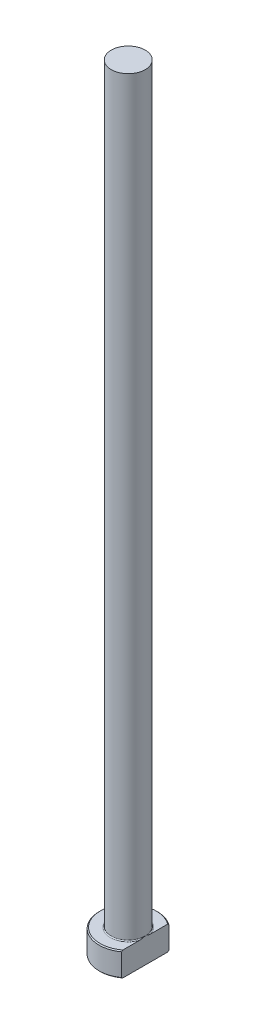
ISO-10303-21;
HEADER;
FILE_DESCRIPTION(('STEP AP214'),'2;1');
FILE_NAME('part.step','',(''),(''),'','','');
FILE_SCHEMA(('AUTOMOTIVE_DESIGN { 1 0 10303 214 1 1 1 1 }'));
ENDSEC;
DATA;
#1=APPLICATION_CONTEXT('core data for automotive mechanical design processes');
#2=APPLICATION_PROTOCOL_DEFINITION('international standard','automotive_design',2000,#1);
#3=PRODUCT_CONTEXT('',#1,'mechanical');
#4=PRODUCT('Part','Part','',(#3));
#5=PRODUCT_RELATED_PRODUCT_CATEGORY('part','',(#4));
#6=PRODUCT_DEFINITION_FORMATION('','',#4);
#7=PRODUCT_DEFINITION_CONTEXT('part definition',#1,'design');
#8=PRODUCT_DEFINITION('design','',#6,#7);
#9=PRODUCT_DEFINITION_SHAPE('','',#8);
#10=(LENGTH_UNIT() NAMED_UNIT(*) SI_UNIT(.MILLI.,.METRE.));
#11=(NAMED_UNIT(*) PLANE_ANGLE_UNIT() SI_UNIT($,.RADIAN.));
#12=(NAMED_UNIT(*) SI_UNIT($,.STERADIAN.) SOLID_ANGLE_UNIT());
#13=UNCERTAINTY_MEASURE_WITH_UNIT(LENGTH_MEASURE(1.E-05),#10,'distance_accuracy_value','');
#14=(GEOMETRIC_REPRESENTATION_CONTEXT(3) GLOBAL_UNCERTAINTY_ASSIGNED_CONTEXT((#13)) GLOBAL_UNIT_ASSIGNED_CONTEXT((#10,
#11,#12)) REPRESENTATION_CONTEXT('',''));
#15=CARTESIAN_POINT('',(0.,0.,0.));
#16=DIRECTION('',(0.,0.,1.));
#17=DIRECTION('',(1.,0.,0.));
#18=AXIS2_PLACEMENT_3D('',#15,#16,#17);
#19=CARTESIAN_POINT('',(0.,0.,0.));
#20=DIRECTION('',(0.,-1.,0.));
#21=DIRECTION('',(0.,0.,-1.));
#22=AXIS2_PLACEMENT_3D('',#19,#20,#21);
#23=PLANE('',#22);
#24=CARTESIAN_POINT('',(0.,0.,0.));
#25=DIRECTION('',(0.,-1.,0.));
#26=DIRECTION('',(0.,0.,-1.));
#27=AXIS2_PLACEMENT_3D('',#24,#25,#26);
#28=CIRCLE('',#27,5.79999999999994);
#29=CARTESIAN_POINT('',(3.49999999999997,0.,4.62493243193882));
#30=VERTEX_POINT('',#29);
#31=CARTESIAN_POINT('',(3.49999999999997,0.,-4.62493243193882));
#32=VERTEX_POINT('',#31);
#33=EDGE_CURVE('E98',#30,#32,#28,.T.);
#34=ORIENTED_EDGE('',*,*,#33,.T.);
#35=DIRECTION('',(0.,0.,1.));
#36=VECTOR('',#35,1.);
#37=CARTESIAN_POINT('',(3.49999999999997,0.,-4.87339717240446));
#38=LINE('',#37,#36);
#39=EDGE_CURVE('E83',#32,#30,#38,.T.);
#40=ORIENTED_EDGE('',*,*,#39,.T.);
#41=EDGE_LOOP('',(#34,#40));
#42=FACE_BOUND('',#41,.T.);
#43=ADVANCED_FACE('F32',(#42),#23,.T.);
#44=CARTESIAN_POINT('',(0.,259.958771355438,0.));
#45=DIRECTION('',(0.,1.,0.));
#46=DIRECTION('',(0.,0.,1.));
#47=AXIS2_PLACEMENT_3D('',#44,#45,#46);
#48=CYLINDRICAL_SURFACE('',#47,5.99999999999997);
#49=CARTESIAN_POINT('',(0.,4.80000000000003,0.));
#50=DIRECTION('',(0.,1.,0.));
#51=DIRECTION('',(0.,0.,1.));
#52=AXIS2_PLACEMENT_3D('',#49,#50,#51);
#53=CIRCLE('',#52,5.99999999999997);
#54=CARTESIAN_POINT('',(3.49999999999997,4.80000000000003,4.87339717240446));
#55=VERTEX_POINT('',#54);
#56=CARTESIAN_POINT('',(3.49999999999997,4.80000000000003,-4.87339717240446));
#57=VERTEX_POINT('',#56);
#58=EDGE_CURVE('E104',#55,#57,#53,.F.);
#59=ORIENTED_EDGE('',*,*,#58,.T.);
#60=DIRECTION('',(0.,-1.,0.));
#61=VECTOR('',#60,1.);
#62=CARTESIAN_POINT('',(3.49999999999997,160.,-4.87339717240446));
#63=LINE('',#62,#61);
#64=CARTESIAN_POINT('',(3.49999999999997,0.200000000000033,-4.87339717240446));
#65=VERTEX_POINT('',#64);
#66=EDGE_CURVE('E183',#57,#65,#63,.T.);
#67=ORIENTED_EDGE('',*,*,#66,.T.);
#68=CARTESIAN_POINT('',(0.,0.200000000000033,0.));
#69=DIRECTION('',(0.,-1.,0.));
#70=DIRECTION('',(0.,0.,-1.));
#71=AXIS2_PLACEMENT_3D('',#68,#69,#70);
#72=CIRCLE('',#71,5.99999999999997);
#73=CARTESIAN_POINT('',(3.49999999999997,0.200000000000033,4.87339717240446));
#74=VERTEX_POINT('',#73);
#75=EDGE_CURVE('E100',#65,#74,#72,.F.);
#76=ORIENTED_EDGE('',*,*,#75,.T.);
#77=DIRECTION('',(0.,-1.,0.));
#78=VECTOR('',#77,1.);
#79=CARTESIAN_POINT('',(3.49999999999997,160.,4.87339717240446));
#80=LINE('',#79,#78);
#81=EDGE_CURVE('E93',#55,#74,#80,.T.);
#82=ORIENTED_EDGE('',*,*,#81,.F.);
#83=EDGE_LOOP('',(#59,#67,#76,#82));
#84=FACE_BOUND('',#83,.T.);
#85=ADVANCED_FACE('F158',(#84),#48,.T.);
#86=CARTESIAN_POINT('',(-5.99999999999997,5.,0.));
#87=DIRECTION('',(0.,1.,0.));
#88=DIRECTION('',(0.,0.,1.));
#89=AXIS2_PLACEMENT_3D('',#86,#87,#88);
#90=PLANE('',#89);
#91=CARTESIAN_POINT('',(0.,5.,0.));
#92=DIRECTION('',(0.,1.,0.));
#93=DIRECTION('',(0.,0.,1.));
#94=AXIS2_PLACEMENT_3D('',#91,#92,#93);
#95=CIRCLE('',#94,5.79999999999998);
#96=CARTESIAN_POINT('',(3.49999999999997,5.,-4.62493243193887));
#97=VERTEX_POINT('',#96);
#98=CARTESIAN_POINT('',(3.49999999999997,5.,4.62493243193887));
#99=VERTEX_POINT('',#98);
#100=EDGE_CURVE('E178',#97,#99,#95,.T.);
#101=ORIENTED_EDGE('',*,*,#100,.T.);
#102=DIRECTION('',(0.,0.,-1.));
#103=VECTOR('',#102,1.);
#104=CARTESIAN_POINT('',(3.49999999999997,5.,0.));
#105=LINE('',#104,#103);
#106=CARTESIAN_POINT('',(3.49999999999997,4.99999999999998,1.19999999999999));
#107=VERTEX_POINT('',#106);
#108=EDGE_CURVE('E57',#99,#107,#105,.T.);
#109=ORIENTED_EDGE('',*,*,#108,.T.);
#110=CARTESIAN_POINT('',(0.,5.,0.));
#111=DIRECTION('',(0.,1.,0.));
#112=DIRECTION('',(0.,0.,1.));
#113=AXIS2_PLACEMENT_3D('',#110,#111,#112);
#114=CIRCLE('',#113,3.69999999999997);
#115=CARTESIAN_POINT('',(3.49999999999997,4.99999999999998,-1.19999999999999));
#116=VERTEX_POINT('',#115);
#117=EDGE_CURVE('E107',#107,#116,#114,.F.);
#118=ORIENTED_EDGE('',*,*,#117,.T.);
#119=EDGE_CURVE('E136',#116,#97,#105,.T.);
#120=ORIENTED_EDGE('',*,*,#119,.T.);
#121=EDGE_LOOP('',(#101,#109,#118,#120));
#122=FACE_BOUND('',#121,.T.);
#123=ADVANCED_FACE('F147',(#122),#90,.T.);
#124=CARTESIAN_POINT('',(0.,5.,0.));
#125=DIRECTION('',(0.,-1.,0.));
#126=DIRECTION('',(0.,0.,-1.));
#127=AXIS2_PLACEMENT_3D('',#124,#125,#126);
#128=CONICAL_SURFACE('',#127,5.79999999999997,0.785398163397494);
#129=ORIENTED_EDGE('',*,*,#58,.F.);
#130=CARTESIAN_POINT('',(3.49999999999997,-0.479658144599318,10.7229048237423));
#131=CARTESIAN_POINT('',(3.49999999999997,-0.304627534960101,10.5387821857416));
#132=CARTESIAN_POINT('',(3.49999999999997,-0.12982047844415,10.3544468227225));
#133=CARTESIAN_POINT('',(3.49999999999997,0.219261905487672,9.98527122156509));
#134=CARTESIAN_POINT('',(3.49999999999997,0.39353722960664,9.80043098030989));
#135=CARTESIAN_POINT('',(3.49999999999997,0.91559488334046,9.24486752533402));
#136=CARTESIAN_POINT('',(3.49999999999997,1.26244829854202,8.87327020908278));
#137=CARTESIAN_POINT('',(3.49999999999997,1.95718621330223,8.12195979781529));
#138=CARTESIAN_POINT('',(3.49999999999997,2.30502483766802,7.74220412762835));
#139=CARTESIAN_POINT('',(3.49999999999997,2.82267860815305,7.16898192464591));
#140=CARTESIAN_POINT('',(3.49999999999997,2.99451670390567,6.97734293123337));
#141=CARTESIAN_POINT('',(3.49999999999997,3.33649221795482,6.59255347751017));
#142=CARTESIAN_POINT('',(3.49999999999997,3.50662964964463,6.39940302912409));
#143=CARTESIAN_POINT('',(3.49999999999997,3.80984794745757,6.05127590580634));
#144=CARTESIAN_POINT('',(3.49999999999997,3.9433293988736,5.89664839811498));
#145=CARTESIAN_POINT('',(3.49999999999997,4.20861192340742,5.58595941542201));
#146=CARTESIAN_POINT('',(3.49999999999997,4.34041301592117,5.42989795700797));
#147=CARTESIAN_POINT('',(3.49999999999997,4.60204886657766,5.11587234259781));
#148=CARTESIAN_POINT('',(3.49999999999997,4.73188156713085,4.9579064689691));
#149=CARTESIAN_POINT('',(3.49999999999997,4.98887681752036,4.63982145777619));
#150=CARTESIAN_POINT('',(3.49999999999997,5.11603946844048,4.47970240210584));
#151=CARTESIAN_POINT('',(3.49999999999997,5.36664013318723,4.15712646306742));
#152=CARTESIAN_POINT('',(3.49999999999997,5.49008567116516,3.99467544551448));
#153=CARTESIAN_POINT('',(3.49999999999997,5.73245687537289,3.6663703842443));
#154=CARTESIAN_POINT('',(3.49999999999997,5.85138169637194,3.50051571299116));
#155=CARTESIAN_POINT('',(3.49999999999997,6.08288587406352,3.16479623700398));
#156=CARTESIAN_POINT('',(3.49999999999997,6.19547497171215,2.99493819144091));
#157=CARTESIAN_POINT('',(3.49999999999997,6.41208556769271,2.6498795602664));
#158=CARTESIAN_POINT('',(3.49999999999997,6.51611116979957,2.47468158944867));
#159=CARTESIAN_POINT('',(3.49999999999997,6.68667355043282,2.16371702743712));
#160=CARTESIAN_POINT('',(3.49999999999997,6.75595020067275,2.02946380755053));
#161=CARTESIAN_POINT('',(3.49999999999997,6.88572771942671,1.75668071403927));
#162=CARTESIAN_POINT('',(3.49999999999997,6.9462264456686,1.61814980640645));
#163=CARTESIAN_POINT('',(3.49999999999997,7.05535730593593,1.33751093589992));
#164=CARTESIAN_POINT('',(3.49999999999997,7.10406788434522,1.1954339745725));
#165=CARTESIAN_POINT('',(3.49999999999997,7.18698872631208,0.907101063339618));
#166=CARTESIAN_POINT('',(3.49999999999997,7.22121012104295,0.760848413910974));
#167=CARTESIAN_POINT('',(3.49999999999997,7.26487302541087,0.507831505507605));
#168=CARTESIAN_POINT('',(3.49999999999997,7.27861043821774,0.401805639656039));
#169=CARTESIAN_POINT('',(3.49999999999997,7.29650595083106,0.188947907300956));
#170=CARTESIAN_POINT('',(3.49999999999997,7.30066582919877,0.0821161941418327));
#171=CARTESIAN_POINT('',(3.49999999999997,7.29916002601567,-0.131492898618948));
#172=CARTESIAN_POINT('',(3.49999999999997,7.29349282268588,-0.238270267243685));
#173=CARTESIAN_POINT('',(3.49999999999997,7.27266406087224,-0.450895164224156));
#174=CARTESIAN_POINT('',(3.49999999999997,7.25750065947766,-0.556742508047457));
#175=CARTESIAN_POINT('',(3.49999999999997,7.21256554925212,-0.79858965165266));
#176=CARTESIAN_POINT('',(3.49999999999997,7.17976248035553,-0.934025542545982));
#177=CARTESIAN_POINT('',(3.49999999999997,7.10180151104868,-1.20127435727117));
#178=CARTESIAN_POINT('',(3.49999999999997,7.05663717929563,-1.33308535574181));
#179=CARTESIAN_POINT('',(3.49999999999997,6.95617548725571,-1.59358719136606));
#180=CARTESIAN_POINT('',(3.49999999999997,6.90082290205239,-1.72225647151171));
#181=CARTESIAN_POINT('',(3.49999999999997,6.81196782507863,-1.91246868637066));
#182=CARTESIAN_POINT('',(3.49999999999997,6.78138093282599,-1.97540288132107));
#183=CARTESIAN_POINT('',(3.49999999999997,6.71848328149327,-2.10040375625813));
#184=CARTESIAN_POINT('',(3.49999999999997,6.68617255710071,-2.16247045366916));
#185=CARTESIAN_POINT('',(3.49999999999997,6.59348343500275,-2.33529342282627));
#186=CARTESIAN_POINT('',(3.49999999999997,6.53139715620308,-2.44513435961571));
#187=CARTESIAN_POINT('',(3.49999999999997,6.40327495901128,-2.66249790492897));
#188=CARTESIAN_POINT('',(3.49999999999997,6.33723828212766,-2.77002006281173));
#189=CARTESIAN_POINT('',(3.49999999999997,6.20193961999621,-2.98310926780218));
#190=CARTESIAN_POINT('',(3.49999999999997,6.13267551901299,-3.08867496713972));
#191=CARTESIAN_POINT('',(3.49999999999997,5.99154722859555,-3.29805772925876));
#192=CARTESIAN_POINT('',(3.49999999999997,5.91968285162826,-3.40187466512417));
#193=CARTESIAN_POINT('',(3.49999999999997,5.70053198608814,-3.71160333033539));
#194=CARTESIAN_POINT('',(3.49999999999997,5.55004115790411,-3.91524708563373));
#195=CARTESIAN_POINT('',(3.49999999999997,5.24323373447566,-4.31793623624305));
#196=CARTESIAN_POINT('',(3.49999999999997,5.08691924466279,-4.5169832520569));
#197=CARTESIAN_POINT('',(3.49999999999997,4.76917008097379,-4.91272714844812));
#198=CARTESIAN_POINT('',(3.49999999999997,4.60771212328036,-5.10940527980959));
#199=CARTESIAN_POINT('',(3.49999999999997,4.28159454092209,-5.50010578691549));
#200=CARTESIAN_POINT('',(3.49999999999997,4.11693466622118,-5.69412795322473));
#201=CARTESIAN_POINT('',(3.49999999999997,3.7854437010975,-6.07977702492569));
#202=CARTESIAN_POINT('',(3.49999999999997,3.61861641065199,-6.27140720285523));
#203=CARTESIAN_POINT('',(3.49999999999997,3.28306967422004,-6.65300504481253));
#204=CARTESIAN_POINT('',(3.49999999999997,3.11435020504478,-6.84297268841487));
#205=CARTESIAN_POINT('',(3.49999999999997,2.66324311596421,-7.3468737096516));
#206=CARTESIAN_POINT('',(3.49999999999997,2.37954008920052,-7.65962881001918));
#207=CARTESIAN_POINT('',(3.49999999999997,1.80910784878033,-8.28261634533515));
#208=CARTESIAN_POINT('',(3.49999999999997,1.52237733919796,-8.59284759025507));
#209=CARTESIAN_POINT('',(3.49999999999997,0.950562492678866,-9.20727688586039));
#210=CARTESIAN_POINT('',(3.49999999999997,0.665505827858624,-9.51150072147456));
#211=CARTESIAN_POINT('',(3.49999999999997,0.0939335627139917,-10.1182972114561));
#212=CARTESIAN_POINT('',(3.49999999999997,-0.192581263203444,-10.4208705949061));
#213=CARTESIAN_POINT('',(3.49999999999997,-0.479658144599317,-10.7229048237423));
#214=B_SPLINE_CURVE_WITH_KNOTS('',3,(#130,#131,#132,#133,#134,#135,#136,#137,#138,#139,#140,
#141,#142,#143,#144,#145,#146,#147,#148,#149,#150,#151,#152,#153,#154,#155,#156,#157,#158,#159,
#160,#161,#162,#163,#164,#165,#166,#167,#168,#169,#170,#171,#172,#173,#174,#175,#176,#177,#178,
#179,#180,#181,#182,#183,#184,#185,#186,#187,#188,#189,#190,#191,#192,#193,#194,#195,#196,#197,
#198,#199,#200,#201,#202,#203,#204,#205,#206,#207,#208,#209,#210,#211,#212,#213),.UNSPECIFIED.,
.F.,.F.,(4,2,2,2,2,2,2,2,2,2,2,2,2,2,2,2,2,2,2,2,2,2,2,2,2,2,2,2,2,2,2,2,2,2,2,2,2,2,2,2,2,4),
(0.,0.762123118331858,1.52425095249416,3.04920520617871,4.59410962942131,5.36629689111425,
6.13847806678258,6.75128402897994,7.36408291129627,7.97748343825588,8.59086070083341,
9.20289910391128,9.81505138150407,10.4262352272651,11.0371244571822,11.4901076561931,
11.94320122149,12.393191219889,12.842834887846,13.1631796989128,13.4834650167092,
13.8037999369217,14.1241970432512,14.5415079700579,14.9590364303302,15.3788985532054,
15.5887982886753,15.7986938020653,16.1771020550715,16.5555831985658,16.9343160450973,
17.3130762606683,18.0725457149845,18.8317432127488,19.5950831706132,20.3584829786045,
21.1206884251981,21.88290322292,23.1496528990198,24.4169687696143,25.6676760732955,
26.9177769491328),.UNSPECIFIED.);
#215=EDGE_CURVE('E135',#55,#99,#214,.T.);
#216=ORIENTED_EDGE('',*,*,#215,.T.);
#217=ORIENTED_EDGE('',*,*,#100,.F.);
#218=EDGE_CURVE('E127',#97,#57,#214,.T.);
#219=ORIENTED_EDGE('',*,*,#218,.T.);
#220=EDGE_LOOP('',(#129,#216,#217,#219));
#221=FACE_BOUND('',#220,.T.);
#222=ADVANCED_FACE('F143',(#221),#128,.T.);
#223=CARTESIAN_POINT('',(0.,0.200000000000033,0.));
#224=DIRECTION('',(0.,1.,0.));
#225=DIRECTION('',(0.,0.,1.));
#226=AXIS2_PLACEMENT_3D('',#223,#224,#225);
#227=CONICAL_SURFACE('',#226,5.99999999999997,0.785398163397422);
#228=ORIENTED_EDGE('',*,*,#75,.F.);
#229=CARTESIAN_POINT('',(3.49999999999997,5.47965814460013,-10.7229048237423));
#230=CARTESIAN_POINT('',(3.49999999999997,5.3046275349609,-10.5387821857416));
#231=CARTESIAN_POINT('',(3.49999999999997,5.12982047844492,-10.3544468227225));
#232=CARTESIAN_POINT('',(3.49999999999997,4.78073809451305,-9.9852712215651));
#233=CARTESIAN_POINT('',(3.49999999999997,4.60646277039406,-9.80043098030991));
#234=CARTESIAN_POINT('',(3.49999999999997,4.08440511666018,-9.24486752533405));
#235=CARTESIAN_POINT('',(3.49999999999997,3.73755170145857,-8.87327020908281));
#236=CARTESIAN_POINT('',(3.49999999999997,3.04281378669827,-8.12195979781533));
#237=CARTESIAN_POINT('',(3.49999999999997,2.69497516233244,-7.74220412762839));
#238=CARTESIAN_POINT('',(3.49999999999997,2.17732139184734,-7.16898192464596));
#239=CARTESIAN_POINT('',(3.49999999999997,2.0054832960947,-6.97734293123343));
#240=CARTESIAN_POINT('',(3.49999999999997,1.66350778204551,-6.59255347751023));
#241=CARTESIAN_POINT('',(3.49999999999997,1.49337035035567,-6.39940302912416));
#242=CARTESIAN_POINT('',(3.49999999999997,1.1901520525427,-6.05127590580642));
#243=CARTESIAN_POINT('',(3.49999999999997,1.05667060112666,-5.89664839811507));
#244=CARTESIAN_POINT('',(3.49999999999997,0.791388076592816,-5.58595941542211));
#245=CARTESIAN_POINT('',(3.49999999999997,0.659586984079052,-5.42989795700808));
#246=CARTESIAN_POINT('',(3.49999999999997,0.397951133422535,-5.11587234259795));
#247=CARTESIAN_POINT('',(3.49999999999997,0.26811843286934,-4.95790646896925));
#248=CARTESIAN_POINT('',(3.49999999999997,0.0111231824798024,-4.63982145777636));
#249=CARTESIAN_POINT('',(3.49999999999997,-0.116039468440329,-4.47970240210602));
#250=CARTESIAN_POINT('',(3.49999999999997,-0.366640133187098,-4.15712646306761));
#251=CARTESIAN_POINT('',(3.49999999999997,-0.490085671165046,-3.99467544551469));
#252=CARTESIAN_POINT('',(3.49999999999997,-0.7324568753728,-3.66637038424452));
#253=CARTESIAN_POINT('',(3.49999999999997,-0.851381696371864,-3.50051571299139));
#254=CARTESIAN_POINT('',(3.49999999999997,-1.08288587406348,-3.16479623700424));
#255=CARTESIAN_POINT('',(3.49999999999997,-1.19547497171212,-2.99493819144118));
#256=CARTESIAN_POINT('',(3.49999999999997,-1.41208556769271,-2.64987956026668));
#257=CARTESIAN_POINT('',(3.49999999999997,-1.51611116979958,-2.47468158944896));
#258=CARTESIAN_POINT('',(3.49999999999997,-1.68667355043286,-2.16371702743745));
#259=CARTESIAN_POINT('',(3.49999999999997,-1.7559502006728,-2.02946380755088));
#260=CARTESIAN_POINT('',(3.49999999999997,-1.88572771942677,-1.75668071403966));
#261=CARTESIAN_POINT('',(3.49999999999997,-1.94622644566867,-1.61814980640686));
#262=CARTESIAN_POINT('',(3.49999999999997,-2.05535730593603,-1.33751093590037));
#263=CARTESIAN_POINT('',(3.49999999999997,-2.10406788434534,-1.19543397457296));
#264=CARTESIAN_POINT('',(3.49999999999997,-2.18698872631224,-0.907101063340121));
#265=CARTESIAN_POINT('',(3.49999999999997,-2.22121012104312,-0.760848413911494));
#266=CARTESIAN_POINT('',(3.49999999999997,-2.26487302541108,-0.507831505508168));
#267=CARTESIAN_POINT('',(3.49999999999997,-2.27861043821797,-0.401805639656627));
#268=CARTESIAN_POINT('',(3.49999999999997,-2.29650595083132,-0.188947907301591));
#269=CARTESIAN_POINT('',(3.49999999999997,-2.30066582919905,-0.0821161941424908));
#270=CARTESIAN_POINT('',(3.49999999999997,-2.299160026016,0.131492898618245));
#271=CARTESIAN_POINT('',(3.49999999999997,-2.29349282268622,0.238270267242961));
#272=CARTESIAN_POINT('',(3.49999999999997,-2.27266406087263,0.450895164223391));
#273=CARTESIAN_POINT('',(3.49999999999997,-2.25750065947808,0.556742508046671));
#274=CARTESIAN_POINT('',(3.49999999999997,-2.2125655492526,0.798589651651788));
#275=CARTESIAN_POINT('',(3.49999999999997,-2.17976248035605,0.934025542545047));
#276=CARTESIAN_POINT('',(3.49999999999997,-2.10180151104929,1.20127435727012));
#277=CARTESIAN_POINT('',(3.49999999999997,-2.05663717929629,1.3330853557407));
#278=CARTESIAN_POINT('',(3.49999999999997,-1.95617548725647,1.59358719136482));
#279=CARTESIAN_POINT('',(3.49999999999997,-1.9008229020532,1.72225647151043));
#280=CARTESIAN_POINT('',(3.49999999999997,-1.81196782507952,1.91246868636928));
#281=CARTESIAN_POINT('',(3.49999999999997,-1.7813809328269,1.97540288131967));
#282=CARTESIAN_POINT('',(3.49999999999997,-1.71848328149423,2.10040375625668));
#283=CARTESIAN_POINT('',(3.49999999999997,-1.6861725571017,2.16247045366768));
#284=CARTESIAN_POINT('',(3.49999999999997,-1.59348343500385,2.33529342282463));
#285=CARTESIAN_POINT('',(3.49999999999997,-1.53139715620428,2.44513435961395));
#286=CARTESIAN_POINT('',(3.49999999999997,-1.40327495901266,2.66249790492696));
#287=CARTESIAN_POINT('',(3.49999999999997,-1.33723828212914,2.7700200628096));
#288=CARTESIAN_POINT('',(3.49999999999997,-1.20193961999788,2.98310926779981));
#289=CARTESIAN_POINT('',(3.49999999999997,-1.13267551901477,3.08867496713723));
#290=CARTESIAN_POINT('',(3.49999999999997,-0.99154722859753,3.29805772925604));
#291=CARTESIAN_POINT('',(3.49999999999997,-0.919682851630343,3.40187466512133));
#292=CARTESIAN_POINT('',(3.49999999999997,-0.700531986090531,3.71160333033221));
#293=CARTESIAN_POINT('',(3.49999999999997,-0.550041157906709,3.91524708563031));
#294=CARTESIAN_POINT('',(3.49999999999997,-0.243233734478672,4.31793623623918));
#295=CARTESIAN_POINT('',(3.49999999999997,-0.0869192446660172,4.5169832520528));
#296=CARTESIAN_POINT('',(3.49999999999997,0.230829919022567,4.91272714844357));
#297=CARTESIAN_POINT('',(3.49999999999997,0.39228787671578,5.10940527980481));
#298=CARTESIAN_POINT('',(3.49999999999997,0.718405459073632,5.50010578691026));
#299=CARTESIAN_POINT('',(3.49999999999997,0.883065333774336,5.69412795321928));
#300=CARTESIAN_POINT('',(3.49999999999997,1.21455629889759,6.07977702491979));
#301=CARTESIAN_POINT('',(3.49999999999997,1.3813835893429,6.2714072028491));
#302=CARTESIAN_POINT('',(3.49999999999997,1.71693032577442,6.65300504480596));
#303=CARTESIAN_POINT('',(3.49999999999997,1.88564979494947,6.84297268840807));
#304=CARTESIAN_POINT('',(3.49999999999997,2.33675688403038,7.34687370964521));
#305=CARTESIAN_POINT('',(3.49999999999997,2.62045991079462,7.6596288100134));
#306=CARTESIAN_POINT('',(3.49999999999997,3.19089215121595,8.28261634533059));
#307=CARTESIAN_POINT('',(3.49999999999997,3.47762266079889,8.59284759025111));
#308=CARTESIAN_POINT('',(3.49999999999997,4.04943750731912,9.20727688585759));
#309=CARTESIAN_POINT('',(3.49999999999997,4.33449417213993,9.51150072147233));
#310=CARTESIAN_POINT('',(3.49999999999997,4.90606643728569,10.118297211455));
#311=CARTESIAN_POINT('',(3.49999999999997,5.19258126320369,10.4208705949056));
#312=CARTESIAN_POINT('',(3.49999999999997,5.47965814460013,10.7229048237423));
#313=B_SPLINE_CURVE_WITH_KNOTS('',3,(#229,#230,#231,#232,#233,#234,#235,#236,#237,#238,#239,
#240,#241,#242,#243,#244,#245,#246,#247,#248,#249,#250,#251,#252,#253,#254,#255,#256,#257,#258,
#259,#260,#261,#262,#263,#264,#265,#266,#267,#268,#269,#270,#271,#272,#273,#274,#275,#276,#277,
#278,#279,#280,#281,#282,#283,#284,#285,#286,#287,#288,#289,#290,#291,#292,#293,#294,#295,#296,
#297,#298,#299,#300,#301,#302,#303,#304,#305,#306,#307,#308,#309,#310,#311,#312),.UNSPECIFIED.,
.F.,.F.,(4,2,2,2,2,2,2,2,2,2,2,2,2,2,2,2,2,2,2,2,2,2,2,2,2,2,2,2,2,2,2,2,2,2,2,2,2,2,2,2,2,4),
(0.,0.762123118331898,1.52425095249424,3.04920520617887,4.59410962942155,5.36629689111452,
6.13847806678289,6.75128402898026,7.36408291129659,7.9774834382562,8.59086070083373,
9.20289910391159,9.81505138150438,10.4262352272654,11.0371244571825,11.4901076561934,
11.9432012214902,12.3931912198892,12.8428348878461,13.1631796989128,13.4834650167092,
13.8037999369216,14.1241970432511,14.5415079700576,14.9590364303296,15.3788985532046,
15.5887982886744,15.7986938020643,16.1771020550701,16.5555831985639,16.9343160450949,
17.3130762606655,18.0725457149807,18.8317432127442,19.5950831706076,20.3584829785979,
21.1206884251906,21.8829032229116,23.1496528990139,24.4169687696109,25.6676760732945,
26.9177769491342),.UNSPECIFIED.);
#314=EDGE_CURVE('E86',#65,#32,#313,.T.);
#315=ORIENTED_EDGE('',*,*,#314,.T.);
#316=ORIENTED_EDGE('',*,*,#33,.F.);
#317=EDGE_CURVE('E89',#30,#74,#313,.T.);
#318=ORIENTED_EDGE('',*,*,#317,.T.);
#319=EDGE_LOOP('',(#228,#315,#316,#318));
#320=FACE_BOUND('',#319,.T.);
#321=ADVANCED_FACE('F97',(#320),#227,.T.);
#322=CARTESIAN_POINT('',(0.,5.19999999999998,0.));
#323=DIRECTION('',(0.,1.,0.));
#324=DIRECTION('',(0.,0.,1.));
#325=AXIS2_PLACEMENT_3D('',#322,#323,#324);
#326=TOROIDAL_SURFACE('',#325,3.69999999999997,0.2);
#327=CARTESIAN_POINT('',(3.49999999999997,5.19999999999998,0.));
#328=CARTESIAN_POINT('',(3.49999999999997,5.20000050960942,9.98094828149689E-11));
#329=CARTESIAN_POINT('',(3.49999999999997,5.20000101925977,-2.13486746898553E-07));
#330=CARTESIAN_POINT('',(3.49999999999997,5.20000196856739,-7.957591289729E-07));
#331=CARTESIAN_POINT('',(3.49999999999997,5.20000239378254,-1.17925839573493E-06));
#332=CARTESIAN_POINT('',(3.49999999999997,5.20000328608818,-2.10014972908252E-06));
#333=CARTESIAN_POINT('',(3.49999999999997,5.20000373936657,-2.65249908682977E-06));
#334=CARTESIAN_POINT('',(3.49999999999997,5.20000454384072,-3.79112889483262E-06));
#335=CARTESIAN_POINT('',(3.49999999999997,5.20000489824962,-4.37533521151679E-06));
#336=CARTESIAN_POINT('',(3.49999999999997,5.20000623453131,-6.66270059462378E-06));
#337=CARTESIAN_POINT('',(3.49999999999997,5.20000714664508,-8.40961025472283E-06));
#338=CARTESIAN_POINT('',(3.49999999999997,5.20000862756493,-1.18496824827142E-05));
#339=CARTESIAN_POINT('',(3.49999999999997,5.20000922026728,-1.35329548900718E-05));
#340=CARTESIAN_POINT('',(3.49999999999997,5.20001174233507,-2.07268950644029E-05));
#341=CARTESIAN_POINT('',(3.49999999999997,5.20001365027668,-2.62477536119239E-05));
#342=CARTESIAN_POINT('',(3.49999999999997,5.20001642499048,-3.66274572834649E-05));
#343=CARTESIAN_POINT('',(3.49999999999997,5.20001740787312,-4.14549355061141E-05));
#344=CARTESIAN_POINT('',(3.49999999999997,5.20002462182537,-7.75352102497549E-05));
#345=CARTESIAN_POINT('',(3.49999999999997,5.20003014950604,-0.000108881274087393));
#346=CARTESIAN_POINT('',(3.49999999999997,5.20005434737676,-0.000233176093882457));
#347=CARTESIAN_POINT('',(3.49999999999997,5.20007737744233,-0.000325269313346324));
#348=CARTESIAN_POINT('',(3.49999999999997,5.20016742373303,-0.000691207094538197));
#349=CARTESIAN_POINT('',(3.49999999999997,5.20023166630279,-0.000965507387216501));
#350=CARTESIAN_POINT('',(3.49999999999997,5.20048971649,-0.0020594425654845));
#351=CARTESIAN_POINT('',(3.49999999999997,5.20068705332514,-0.00287847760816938));
#352=CARTESIAN_POINT('',(3.49999999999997,5.20150941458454,-0.00630050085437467));
#353=CARTESIAN_POINT('',(3.49999999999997,5.20212997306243,-0.00890424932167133));
#354=CARTESIAN_POINT('',(3.49999999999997,5.20703918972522,-0.0294912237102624));
#355=CARTESIAN_POINT('',(3.49999999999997,5.21134300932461,-0.0474719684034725));
#356=CARTESIAN_POINT('',(3.49999999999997,5.21975360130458,-0.0827191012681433));
#357=CARTESIAN_POINT('',(3.49999999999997,5.22386136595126,-0.0999852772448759));
#358=CARTESIAN_POINT('',(3.49999999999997,5.2372401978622,-0.156405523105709));
#359=CARTESIAN_POINT('',(3.49999999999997,5.24645854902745,-0.195572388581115));
#360=CARTESIAN_POINT('',(3.49999999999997,5.26203234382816,-0.262828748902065));
#361=CARTESIAN_POINT('',(3.49999999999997,5.26845671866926,-0.290902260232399));
#362=CARTESIAN_POINT('',(3.49999999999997,5.28094671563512,-0.346379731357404));
#363=CARTESIAN_POINT('',(3.49999999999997,5.28701730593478,-0.373782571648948));
#364=CARTESIAN_POINT('',(3.49999999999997,5.30077691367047,-0.437211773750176));
#365=CARTESIAN_POINT('',(3.49999999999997,5.3083789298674,-0.473257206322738));
#366=CARTESIAN_POINT('',(3.49999999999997,5.32309409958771,-0.545736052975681));
#367=CARTESIAN_POINT('',(3.49999999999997,5.33020304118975,-0.582170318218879));
#368=CARTESIAN_POINT('',(3.49999999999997,5.35161649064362,-0.697757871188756));
#369=CARTESIAN_POINT('',(3.49999999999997,5.36463967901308,-0.777158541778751));
#370=CARTESIAN_POINT('',(3.49999999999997,5.3843837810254,-0.92756184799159));
#371=CARTESIAN_POINT('',(3.49999999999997,5.39165512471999,-0.998486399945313));
#372=CARTESIAN_POINT('',(3.49999999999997,5.3979989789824,-1.10437287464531));
#373=CARTESIAN_POINT('',(3.49999999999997,5.39936233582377,-1.13919451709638));
#374=CARTESIAN_POINT('',(3.49999999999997,5.40028946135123,-1.20885098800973));
#375=CARTESIAN_POINT('',(3.49999999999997,5.39985418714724,-1.24368579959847));
#376=CARTESIAN_POINT('',(3.49999999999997,5.39686573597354,-1.30963279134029));
#377=CARTESIAN_POINT('',(3.49999999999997,5.39453835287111,-1.34075403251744));
#378=CARTESIAN_POINT('',(3.49999999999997,5.38750048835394,-1.40298456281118));
#379=CARTESIAN_POINT('',(3.49999999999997,5.38277118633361,-1.43409178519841));
#380=CARTESIAN_POINT('',(3.49999999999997,5.37000596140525,-1.49609278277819));
#381=CARTESIAN_POINT('',(3.49999999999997,5.36193044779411,-1.52697933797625));
#382=CARTESIAN_POINT('',(3.49999999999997,5.34614337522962,-1.57192957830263));
#383=CARTESIAN_POINT('',(3.49999999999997,5.3402919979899,-1.5866404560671));
#384=CARTESIAN_POINT('',(3.49999999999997,5.32701491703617,-1.6153215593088));
#385=CARTESIAN_POINT('',(3.49999999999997,5.31959341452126,-1.6292936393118));
#386=CARTESIAN_POINT('',(3.49999999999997,5.30547056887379,-1.65150372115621));
#387=CARTESIAN_POINT('',(3.49999999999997,5.29934759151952,-1.6601058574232));
#388=CARTESIAN_POINT('',(3.49999999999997,5.28595656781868,-1.67637400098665));
#389=CARTESIAN_POINT('',(3.49999999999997,5.27869146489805,-1.68404232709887));
#390=CARTESIAN_POINT('',(3.49999999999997,5.26587375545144,-1.69518467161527));
#391=CARTESIAN_POINT('',(3.49999999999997,5.26073958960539,-1.69913647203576));
#392=CARTESIAN_POINT('',(3.49999999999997,5.24994100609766,-1.70624293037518));
#393=CARTESIAN_POINT('',(3.49999999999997,5.24427723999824,-1.70939855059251));
#394=CARTESIAN_POINT('',(3.49999999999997,5.23351378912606,-1.71418736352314));
#395=CARTESIAN_POINT('',(3.49999999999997,5.22849079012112,-1.71599090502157));
#396=CARTESIAN_POINT('',(3.49999999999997,5.21821361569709,-1.71873268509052));
#397=CARTESIAN_POINT('',(3.49999999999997,5.21295968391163,-1.71967181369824));
#398=CARTESIAN_POINT('',(3.49999999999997,5.20234462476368,-1.72059432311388));
#399=CARTESIAN_POINT('',(3.49999999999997,5.19698314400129,-1.72057373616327));
#400=CARTESIAN_POINT('',(3.49999999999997,5.18635093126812,-1.71956893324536));
#401=CARTESIAN_POINT('',(3.49999999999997,5.18108024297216,-1.71858426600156));
#402=CARTESIAN_POINT('',(3.49999999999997,5.17106869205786,-1.71582968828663));
#403=CARTESIAN_POINT('',(3.49999999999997,5.16631466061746,-1.71410641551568));
#404=CARTESIAN_POINT('',(3.49999999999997,5.15709718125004,-1.71001459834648));
#405=CARTESIAN_POINT('',(3.49999999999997,5.15263381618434,-1.70764587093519));
#406=CARTESIAN_POINT('',(3.49999999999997,5.14110717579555,-1.70060771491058));
#407=CARTESIAN_POINT('',(3.49999999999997,5.13433222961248,-1.69546710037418));
#408=CARTESIAN_POINT('',(3.49999999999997,5.12164557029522,-1.68420869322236));
#409=CARTESIAN_POINT('',(3.49999999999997,5.11573697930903,-1.67808752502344));
#410=CARTESIAN_POINT('',(3.49999999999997,5.10028952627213,-1.66008531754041));
#411=CARTESIAN_POINT('',(3.49999999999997,5.09159238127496,-1.64748936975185));
#412=CARTESIAN_POINT('',(3.49999999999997,5.07604019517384,-1.62125022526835));
#413=CARTESIAN_POINT('',(3.49999999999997,5.06918749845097,-1.60760572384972));
#414=CARTESIAN_POINT('',(3.49999999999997,5.05635908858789,-1.57851190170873));
#415=CARTESIAN_POINT('',(3.49999999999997,5.05050870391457,-1.56300807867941));
#416=CARTESIAN_POINT('',(3.49999999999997,5.04009412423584,-1.53156759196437));
#417=CARTESIAN_POINT('',(3.49999999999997,5.03553147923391,-1.51563043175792));
#418=CARTESIAN_POINT('',(3.49999999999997,5.02331191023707,-1.46712048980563));
#419=CARTESIAN_POINT('',(3.49999999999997,5.01724153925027,-1.4341495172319));
#420=CARTESIAN_POINT('',(3.49999999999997,5.00883071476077,-1.37348993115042));
#421=CARTESIAN_POINT('',(3.49999999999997,5.00603148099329,-1.34585663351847));
#422=CARTESIAN_POINT('',(3.49999999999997,5.00204762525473,-1.29046925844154));
#423=CARTESIAN_POINT('',(3.49999999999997,5.00086336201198,-1.26271515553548));
#424=CARTESIAN_POINT('',(3.49999999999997,4.99925913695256,-1.17922229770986));
#425=CARTESIAN_POINT('',(3.49999999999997,5.00080993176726,-1.1234488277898));
#426=CARTESIAN_POINT('',(3.49999999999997,5.00738569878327,-1.01528124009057));
#427=CARTESIAN_POINT('',(3.49999999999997,5.01221131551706,-0.962872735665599));
#428=CARTESIAN_POINT('',(3.49999999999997,5.02425367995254,-0.858750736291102));
#429=CARTESIAN_POINT('',(3.49999999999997,5.03145152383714,-0.807035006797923));
#430=CARTESIAN_POINT('',(3.49999999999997,5.04786442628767,-0.702500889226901));
#431=CARTESIAN_POINT('',(3.49999999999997,5.05712869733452,-0.649690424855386));
#432=CARTESIAN_POINT('',(3.49999999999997,5.07730630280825,-0.542969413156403));
#433=CARTESIAN_POINT('',(3.49999999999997,5.08825618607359,-0.489065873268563));
#434=CARTESIAN_POINT('',(3.49999999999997,5.10770336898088,-0.397738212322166));
#435=CARTESIAN_POINT('',(3.49999999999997,5.11594150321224,-0.360258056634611));
#436=CARTESIAN_POINT('',(3.49999999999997,5.1326812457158,-0.285797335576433));
#437=CARTESIAN_POINT('',(3.49999999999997,5.14117887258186,-0.248815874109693));
#438=CARTESIAN_POINT('',(3.49999999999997,5.15740628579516,-0.179140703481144));
#439=CARTESIAN_POINT('',(3.49999999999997,5.16511243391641,-0.146441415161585));
#440=CARTESIAN_POINT('',(3.49999999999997,5.18096853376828,-0.0796648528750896));
#441=CARTESIAN_POINT('',(3.49999999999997,5.18912333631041,-0.045588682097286));
#442=CARTESIAN_POINT('',(3.49999999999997,5.19787118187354,-0.00889903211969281));
#443=CARTESIAN_POINT('',(3.49999999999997,5.19849305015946,-0.00629009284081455));
#444=CARTESIAN_POINT('',(3.49999999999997,5.19931571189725,-0.00286690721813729));
#445=CARTESIAN_POINT('',(3.49999999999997,5.19951207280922,-0.0020519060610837));
#446=CARTESIAN_POINT('',(3.49999999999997,5.19976893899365,-0.0009629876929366));
#447=CARTESIAN_POINT('',(3.49999999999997,5.19983295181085,-0.00068966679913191));
#448=CARTESIAN_POINT('',(3.49999999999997,5.19992272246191,-0.000324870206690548));
#449=CARTESIAN_POINT('',(3.49999999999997,5.19994571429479,-0.000232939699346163));
#450=CARTESIAN_POINT('',(3.49999999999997,5.19996987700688,-0.000108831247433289));
#451=CARTESIAN_POINT('',(3.49999999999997,5.19997540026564,-7.75074375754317E-05));
#452=CARTESIAN_POINT('',(3.49999999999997,5.19998260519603,-4.1449950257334E-05));
#453=CARTESIAN_POINT('',(3.49999999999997,5.19998358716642,-3.66236562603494E-05));
#454=CARTESIAN_POINT('',(3.49999999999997,5.19998635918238,-2.62464271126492E-05));
#455=CARTESIAN_POINT('',(3.49999999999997,5.19998826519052,-2.07267962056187E-05));
#456=CARTESIAN_POINT('',(3.49999999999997,5.19999078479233,-1.353414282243E-05));
#457=CARTESIAN_POINT('',(3.49999999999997,5.19999137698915,-1.18509583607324E-05));
#458=CARTESIAN_POINT('',(3.49999999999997,5.19999285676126,-8.4109834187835E-06));
#459=CARTESIAN_POINT('',(3.49999999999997,5.19999376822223,-6.66407126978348E-06));
#460=CARTESIAN_POINT('',(3.49999999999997,5.19999510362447,-4.37661194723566E-06));
#461=CARTESIAN_POINT('',(3.49999999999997,5.19999545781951,-3.79235333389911E-06));
#462=CARTESIAN_POINT('',(3.49999999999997,5.19999626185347,-2.65358032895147E-06));
#463=CARTESIAN_POINT('',(3.49999999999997,5.19999671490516,-2.10113839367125E-06));
#464=CARTESIAN_POINT('',(3.49999999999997,5.1999976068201,-1.18003190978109E-06));
#465=CARTESIAN_POINT('',(3.49999999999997,5.19999803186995,-7.96418762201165E-07));
#466=CARTESIAN_POINT('',(3.49999999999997,5.19999898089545,-2.13855187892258E-07));
#467=CARTESIAN_POINT('',(3.49999999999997,5.19999949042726,-9.98022935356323E-11));
#468=CARTESIAN_POINT('',(3.49999999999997,5.19999999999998,0.));
#469=B_SPLINE_CURVE_WITH_KNOTS('',3,(#327,#328,#329,#330,#331,#332,#333,#334,#335,#336,#337,
#338,#339,#340,#341,#342,#343,#344,#345,#346,#347,#348,#349,#350,#351,#352,#353,#354,#355,#356,
#357,#358,#359,#360,#361,#362,#363,#364,#365,#366,#367,#368,#369,#370,#371,#372,#373,#374,#375,
#376,#377,#378,#379,#380,#381,#382,#383,#384,#385,#386,#387,#388,#389,#390,#391,#392,#393,#394,
#395,#396,#397,#398,#399,#400,#401,#402,#403,#404,#405,#406,#407,#408,#409,#410,#411,#412,#413,
#414,#415,#416,#417,#418,#419,#420,#421,#422,#423,#424,#425,#426,#427,#428,#429,#430,#431,#432,
#433,#434,#435,#436,#437,#438,#439,#440,#441,#442,#443,#444,#445,#446,#447,#448,#449,#450,#451,
#452,#453,#454,#455,#456,#457,#458,#459,#460,#461,#462,#463,#464,#465,#466,#467,#468),
.UNSPECIFIED.,.T.,.F.,(4,2,2,2,2,2,2,2,2,2,2,2,2,2,2,2,2,2,2,2,2,2,2,2,2,2,2,2,2,2,2,2,2,2,2,2,
2,2,2,2,2,2,2,2,2,2,2,2,2,2,2,2,2,2,2,2,2,2,2,2,2,2,2,2,2,2,2,2,2,2,4),(0.,1.54778905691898E-06,
3.27068856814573E-06,5.40032147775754E-06,7.44938901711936E-06,1.3341290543E-05,
1.86900588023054E-05,3.61865044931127E-05,5.09488028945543E-05,0.000146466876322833,
0.000431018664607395,0.0012764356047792,0.00380354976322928,0.0118339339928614,
0.0672984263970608,0.120543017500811,0.24125328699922,0.327650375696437,0.411851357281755,
0.52236238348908,0.633723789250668,0.875007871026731,1.08869711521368,1.19320699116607,
1.29766126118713,1.39121331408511,1.4855099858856,1.58095571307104,1.62839133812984,
1.67570160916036,1.70731126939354,1.73884076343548,1.75822424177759,1.77758417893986,
1.79352969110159,1.80945876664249,1.82545370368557,1.84145613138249,1.8565700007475,
1.8716881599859,1.89705349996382,1.92250811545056,1.96816999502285,2.01388964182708,
2.06352392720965,2.11321770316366,2.21356505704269,2.29684564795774,2.3801447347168,
2.54733140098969,2.70515844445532,2.86175703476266,3.02258329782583,3.18758220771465,
3.30270498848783,3.41653913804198,3.51732480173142,3.62243689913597,3.63048332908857,
3.63299799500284,3.63384039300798,3.63412444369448,3.6342198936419,3.63423465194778,
3.63425214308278,3.63425749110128,3.63426338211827,3.63426543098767,3.63426756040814,
3.63426928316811,3.63427083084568),.UNSPECIFIED.);
#470=CARTESIAN_POINT('',(3.49999999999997,5.19999999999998,0.));
#471=VERTEX_POINT('',#470);
#472=EDGE_CURVE('E11',#116,#471,#469,.T.);
#473=ORIENTED_EDGE('',*,*,#472,.F.);
#474=ORIENTED_EDGE('',*,*,#117,.F.);
#475=CARTESIAN_POINT('',(3.49999999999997,5.19999999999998,0.));
#476=CARTESIAN_POINT('',(3.49999999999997,5.19999949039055,-9.98094430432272E-11));
#477=CARTESIAN_POINT('',(3.49999999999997,5.1999989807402,2.1348674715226E-07));
#478=CARTESIAN_POINT('',(3.49999999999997,5.19999803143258,7.95759129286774E-07));
#479=CARTESIAN_POINT('',(3.49999999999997,5.19999760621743,1.17925839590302E-06));
#480=CARTESIAN_POINT('',(3.49999999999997,5.19999671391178,2.10014972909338E-06));
#481=CARTESIAN_POINT('',(3.49999999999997,5.1999962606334,2.65249908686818E-06));
#482=CARTESIAN_POINT('',(3.49999999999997,5.19999545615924,3.79112889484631E-06));
#483=CARTESIAN_POINT('',(3.49999999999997,5.19999510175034,4.37533521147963E-06));
#484=CARTESIAN_POINT('',(3.49999999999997,5.19999376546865,6.66270059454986E-06));
#485=CARTESIAN_POINT('',(3.49999999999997,5.19999285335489,8.40961025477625E-06));
#486=CARTESIAN_POINT('',(3.49999999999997,5.19999137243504,1.18496824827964E-05));
#487=CARTESIAN_POINT('',(3.49999999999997,5.19999077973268,1.35329548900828E-05));
#488=CARTESIAN_POINT('',(3.49999999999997,5.19998825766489,2.07268950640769E-05));
#489=CARTESIAN_POINT('',(3.49999999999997,5.19998634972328,2.62477536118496E-05));
#490=CARTESIAN_POINT('',(3.49999999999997,5.19998357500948,3.66274572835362E-05));
#491=CARTESIAN_POINT('',(3.49999999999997,5.19998259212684,4.14549355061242E-05));
#492=CARTESIAN_POINT('',(3.49999999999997,5.1999753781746,7.75352102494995E-05));
#493=CARTESIAN_POINT('',(3.49999999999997,5.19996985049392,0.000108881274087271));
#494=CARTESIAN_POINT('',(3.49999999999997,5.1999456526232,0.000233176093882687));
#495=CARTESIAN_POINT('',(3.49999999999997,5.19992262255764,0.000325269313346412));
#496=CARTESIAN_POINT('',(3.49999999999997,5.19983257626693,0.000691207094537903));
#497=CARTESIAN_POINT('',(3.49999999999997,5.19976833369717,0.000965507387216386));
#498=CARTESIAN_POINT('',(3.49999999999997,5.19951028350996,0.00205944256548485));
#499=CARTESIAN_POINT('',(3.49999999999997,5.19931294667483,0.00287847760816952));
#500=CARTESIAN_POINT('',(3.49999999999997,5.19849058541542,0.00630050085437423));
#501=CARTESIAN_POINT('',(3.49999999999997,5.19787002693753,0.00890424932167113));
#502=CARTESIAN_POINT('',(3.49999999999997,5.19296081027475,0.0294912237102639));
#503=CARTESIAN_POINT('',(3.49999999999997,5.18865699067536,0.0474719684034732));
#504=CARTESIAN_POINT('',(3.49999999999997,5.18024639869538,0.0827191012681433));
#505=CARTESIAN_POINT('',(3.49999999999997,5.1761386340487,0.0999852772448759));
#506=CARTESIAN_POINT('',(3.49999999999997,5.16275980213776,0.15640552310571));
#507=CARTESIAN_POINT('',(3.49999999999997,5.15354145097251,0.195572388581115));
#508=CARTESIAN_POINT('',(3.49999999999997,5.1379676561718,0.262828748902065));
#509=CARTESIAN_POINT('',(3.49999999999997,5.13154328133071,0.290902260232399));
#510=CARTESIAN_POINT('',(3.49999999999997,5.11905328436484,0.346379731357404));
#511=CARTESIAN_POINT('',(3.49999999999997,5.11298269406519,0.373782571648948));
#512=CARTESIAN_POINT('',(3.49999999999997,5.09922308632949,0.437211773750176));
#513=CARTESIAN_POINT('',(3.49999999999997,5.09162107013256,0.473257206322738));
#514=CARTESIAN_POINT('',(3.49999999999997,5.07690590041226,0.545736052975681));
#515=CARTESIAN_POINT('',(3.49999999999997,5.06979695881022,0.582170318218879));
#516=CARTESIAN_POINT('',(3.49999999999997,5.04838350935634,0.697757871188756));
#517=CARTESIAN_POINT('',(3.49999999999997,5.03536032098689,0.777158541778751));
#518=CARTESIAN_POINT('',(3.49999999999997,5.01561621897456,0.92756184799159));
#519=CARTESIAN_POINT('',(3.49999999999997,5.00834487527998,0.998486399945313));
#520=CARTESIAN_POINT('',(3.49999999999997,5.00200102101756,1.10437287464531));
#521=CARTESIAN_POINT('',(3.49999999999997,5.00063766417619,1.13919451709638));
#522=CARTESIAN_POINT('',(3.49999999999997,4.99971053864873,1.20885098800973));
#523=CARTESIAN_POINT('',(3.49999999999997,5.00014581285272,1.24368579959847));
#524=CARTESIAN_POINT('',(3.49999999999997,5.00313426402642,1.30963279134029));
#525=CARTESIAN_POINT('',(3.49999999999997,5.00546164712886,1.34075403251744));
#526=CARTESIAN_POINT('',(3.49999999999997,5.01249951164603,1.40298456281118));
#527=CARTESIAN_POINT('',(3.49999999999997,5.01722881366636,1.43409178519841));
#528=CARTESIAN_POINT('',(3.49999999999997,5.02999403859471,1.49609278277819));
#529=CARTESIAN_POINT('',(3.49999999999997,5.03806955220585,1.52697933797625));
#530=CARTESIAN_POINT('',(3.49999999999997,5.05385662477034,1.57192957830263));
#531=CARTESIAN_POINT('',(3.49999999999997,5.05970800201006,1.5866404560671));
#532=CARTESIAN_POINT('',(3.49999999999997,5.0729850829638,1.6153215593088));
#533=CARTESIAN_POINT('',(3.49999999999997,5.0804065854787,1.6292936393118));
#534=CARTESIAN_POINT('',(3.49999999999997,5.09452943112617,1.65150372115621));
#535=CARTESIAN_POINT('',(3.49999999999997,5.10065240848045,1.6601058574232));
#536=CARTESIAN_POINT('',(3.49999999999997,5.11404343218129,1.67637400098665));
#537=CARTESIAN_POINT('',(3.49999999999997,5.12130853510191,1.68404232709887));
#538=CARTESIAN_POINT('',(3.49999999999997,5.13412624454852,1.69518467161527));
#539=CARTESIAN_POINT('',(3.49999999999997,5.13926041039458,1.69913647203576));
#540=CARTESIAN_POINT('',(3.49999999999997,5.1500589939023,1.70624293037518));
#541=CARTESIAN_POINT('',(3.49999999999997,5.15572276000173,1.70939855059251));
#542=CARTESIAN_POINT('',(3.49999999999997,5.1664862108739,1.71418736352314));
#543=CARTESIAN_POINT('',(3.49999999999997,5.17150920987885,1.71599090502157));
#544=CARTESIAN_POINT('',(3.49999999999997,5.18178638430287,1.71873268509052));
#545=CARTESIAN_POINT('',(3.49999999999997,5.18704031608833,1.71967181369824));
#546=CARTESIAN_POINT('',(3.49999999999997,5.19765537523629,1.72059432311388));
#547=CARTESIAN_POINT('',(3.49999999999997,5.20301685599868,1.72057373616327));
#548=CARTESIAN_POINT('',(3.49999999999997,5.21364906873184,1.71956893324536));
#549=CARTESIAN_POINT('',(3.49999999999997,5.21891975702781,1.71858426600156));
#550=CARTESIAN_POINT('',(3.49999999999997,5.22893130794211,1.71582968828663));
#551=CARTESIAN_POINT('',(3.49999999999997,5.23368533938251,1.71410641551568));
#552=CARTESIAN_POINT('',(3.49999999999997,5.24290281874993,1.71001459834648));
#553=CARTESIAN_POINT('',(3.49999999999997,5.24736618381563,1.70764587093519));
#554=CARTESIAN_POINT('',(3.49999999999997,5.25889282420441,1.70060771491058));
#555=CARTESIAN_POINT('',(3.49999999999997,5.26566777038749,1.69546710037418));
#556=CARTESIAN_POINT('',(3.49999999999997,5.27835442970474,1.68420869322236));
#557=CARTESIAN_POINT('',(3.49999999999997,5.28426302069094,1.67808752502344));
#558=CARTESIAN_POINT('',(3.49999999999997,5.29971047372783,1.66008531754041));
#559=CARTESIAN_POINT('',(3.49999999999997,5.30840761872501,1.64748936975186));
#560=CARTESIAN_POINT('',(3.49999999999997,5.32395980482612,1.62125022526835));
#561=CARTESIAN_POINT('',(3.49999999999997,5.33081250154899,1.60760572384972));
#562=CARTESIAN_POINT('',(3.49999999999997,5.34364091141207,1.57851190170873));
#563=CARTESIAN_POINT('',(3.49999999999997,5.34949129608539,1.56300807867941));
#564=CARTESIAN_POINT('',(3.49999999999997,5.35990587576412,1.53156759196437));
#565=CARTESIAN_POINT('',(3.49999999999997,5.36446852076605,1.51563043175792));
#566=CARTESIAN_POINT('',(3.49999999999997,5.37668808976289,1.46712048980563));
#567=CARTESIAN_POINT('',(3.49999999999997,5.3827584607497,1.4341495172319));
#568=CARTESIAN_POINT('',(3.49999999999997,5.3911692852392,1.37348993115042));
#569=CARTESIAN_POINT('',(3.49999999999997,5.39396851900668,1.34585663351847));
#570=CARTESIAN_POINT('',(3.49999999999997,5.39795237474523,1.29046925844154));
#571=CARTESIAN_POINT('',(3.49999999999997,5.39913663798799,1.26271515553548));
#572=CARTESIAN_POINT('',(3.49999999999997,5.40074086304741,1.17922229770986));
#573=CARTESIAN_POINT('',(3.49999999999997,5.3991900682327,1.1234488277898));
#574=CARTESIAN_POINT('',(3.49999999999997,5.39261430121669,1.01528124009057));
#575=CARTESIAN_POINT('',(3.49999999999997,5.3877886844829,0.9628727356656));
#576=CARTESIAN_POINT('',(3.49999999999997,5.37574632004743,0.858750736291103));
#577=CARTESIAN_POINT('',(3.49999999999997,5.36854847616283,0.807035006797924));
#578=CARTESIAN_POINT('',(3.49999999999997,5.3521355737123,0.702500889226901));
#579=CARTESIAN_POINT('',(3.49999999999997,5.34287130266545,0.649690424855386));
#580=CARTESIAN_POINT('',(3.49999999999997,5.32269369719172,0.542969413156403));
#581=CARTESIAN_POINT('',(3.49999999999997,5.31174381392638,0.489065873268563));
#582=CARTESIAN_POINT('',(3.49999999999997,5.29229663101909,0.397738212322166));
#583=CARTESIAN_POINT('',(3.49999999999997,5.28405849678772,0.360258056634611));
#584=CARTESIAN_POINT('',(3.49999999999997,5.26731875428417,0.285797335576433));
#585=CARTESIAN_POINT('',(3.49999999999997,5.2588211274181,0.248815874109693));
#586=CARTESIAN_POINT('',(3.49999999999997,5.24259371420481,0.179140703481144));
#587=CARTESIAN_POINT('',(3.49999999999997,5.23488756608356,0.146441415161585));
#588=CARTESIAN_POINT('',(3.49999999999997,5.21903146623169,0.0796648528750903));
#589=CARTESIAN_POINT('',(3.49999999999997,5.21087666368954,0.0455886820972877));
#590=CARTESIAN_POINT('',(3.49999999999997,5.20212881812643,0.00889903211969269));
#591=CARTESIAN_POINT('',(3.49999999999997,5.20150694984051,0.00629009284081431));
#592=CARTESIAN_POINT('',(3.49999999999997,5.20068428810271,0.00286690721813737));
#593=CARTESIAN_POINT('',(3.49999999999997,5.20048792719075,0.00205190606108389));
#594=CARTESIAN_POINT('',(3.49999999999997,5.20023106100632,0.000962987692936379));
#595=CARTESIAN_POINT('',(3.49999999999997,5.20016704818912,0.000689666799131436));
#596=CARTESIAN_POINT('',(3.49999999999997,5.20007727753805,0.000324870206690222));
#597=CARTESIAN_POINT('',(3.49999999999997,5.20005428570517,0.000232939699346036));
#598=CARTESIAN_POINT('',(3.49999999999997,5.20003012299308,0.000108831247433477));
#599=CARTESIAN_POINT('',(3.49999999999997,5.20002459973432,7.75074375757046E-05));
#600=CARTESIAN_POINT('',(3.49999999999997,5.20001739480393,4.144995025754E-05));
#601=CARTESIAN_POINT('',(3.49999999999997,5.20001641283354,3.66236562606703E-05));
#602=CARTESIAN_POINT('',(3.49999999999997,5.20001364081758,2.62464271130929E-05));
#603=CARTESIAN_POINT('',(3.49999999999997,5.20001173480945,2.07267962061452E-05));
#604=CARTESIAN_POINT('',(3.49999999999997,5.20000921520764,1.35341428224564E-05));
#605=CARTESIAN_POINT('',(3.49999999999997,5.20000862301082,1.18509583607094E-05));
#606=CARTESIAN_POINT('',(3.49999999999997,5.2000071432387,8.41098341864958E-06));
#607=CARTESIAN_POINT('',(3.49999999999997,5.20000623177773,6.664071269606E-06));
#608=CARTESIAN_POINT('',(3.49999999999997,5.20000489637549,4.3766119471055E-06));
#609=CARTESIAN_POINT('',(3.49999999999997,5.20000454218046,3.79235333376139E-06));
#610=CARTESIAN_POINT('',(3.49999999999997,5.2000037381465,2.65358032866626E-06));
#611=CARTESIAN_POINT('',(3.49999999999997,5.20000328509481,2.10113839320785E-06));
#612=CARTESIAN_POINT('',(3.49999999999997,5.20000239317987,1.18003190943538E-06));
#613=CARTESIAN_POINT('',(3.49999999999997,5.20000196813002,7.96418762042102E-07));
#614=CARTESIAN_POINT('',(3.49999999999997,5.20000101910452,2.13855187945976E-07));
#615=CARTESIAN_POINT('',(3.49999999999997,5.20000050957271,9.98022537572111E-11));
#616=CARTESIAN_POINT('',(3.49999999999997,5.19999999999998,0.));
#617=B_SPLINE_CURVE_WITH_KNOTS('',3,(#475,#476,#477,#478,#479,#480,#481,#482,#483,#484,#485,
#486,#487,#488,#489,#490,#491,#492,#493,#494,#495,#496,#497,#498,#499,#500,#501,#502,#503,#504,
#505,#506,#507,#508,#509,#510,#511,#512,#513,#514,#515,#516,#517,#518,#519,#520,#521,#522,#523,
#524,#525,#526,#527,#528,#529,#530,#531,#532,#533,#534,#535,#536,#537,#538,#539,#540,#541,#542,
#543,#544,#545,#546,#547,#548,#549,#550,#551,#552,#553,#554,#555,#556,#557,#558,#559,#560,#561,
#562,#563,#564,#565,#566,#567,#568,#569,#570,#571,#572,#573,#574,#575,#576,#577,#578,#579,#580,
#581,#582,#583,#584,#585,#586,#587,#588,#589,#590,#591,#592,#593,#594,#595,#596,#597,#598,#599,
#600,#601,#602,#603,#604,#605,#606,#607,#608,#609,#610,#611,#612,#613,#614,#615,#616),
.UNSPECIFIED.,.T.,.F.,(4,2,2,2,2,2,2,2,2,2,2,2,2,2,2,2,2,2,2,2,2,2,2,2,2,2,2,2,2,2,2,2,2,2,2,2,
2,2,2,2,2,2,2,2,2,2,2,2,2,2,2,2,2,2,2,2,2,2,2,2,2,2,2,2,2,2,2,2,2,2,4),(0.,1.54778905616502E-06,
3.27068856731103E-06,5.40032147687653E-06,7.44938901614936E-06,1.33412905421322E-05,
1.86900588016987E-05,3.61865044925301E-05,5.09488028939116E-05,0.000146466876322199,
0.000431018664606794,0.0012764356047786,0.00380354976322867,0.0118339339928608,
0.0672984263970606,0.120543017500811,0.241253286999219,0.327650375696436,0.411851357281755,
0.522362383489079,0.633723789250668,0.875007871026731,1.08869711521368,1.19320699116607,
1.29766126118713,1.39121331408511,1.4855099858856,1.58095571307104,1.62839133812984,
1.67570160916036,1.70731126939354,1.73884076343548,1.75822424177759,1.77758417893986,
1.79352969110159,1.80945876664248,1.82545370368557,1.84145613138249,1.8565700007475,
1.8716881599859,1.89705349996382,1.92250811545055,1.96816999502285,2.01388964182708,
2.06352392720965,2.11321770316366,2.21356505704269,2.29684564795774,2.3801447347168,
2.54733140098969,2.70515844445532,2.86175703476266,3.02258329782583,3.18758220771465,
3.30270498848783,3.41653913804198,3.51732480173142,3.62243689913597,3.63048332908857,
3.63299799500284,3.63384039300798,3.63412444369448,3.6342198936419,3.63423465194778,
3.63425214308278,3.63425749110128,3.63426338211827,3.63426543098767,3.63426756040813,
3.63426928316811,3.63427083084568),.UNSPECIFIED.);
#618=EDGE_CURVE('E46',#471,#107,#617,.T.);
#619=ORIENTED_EDGE('',*,*,#618,.F.);
#620=CARTESIAN_POINT('',(0.,5.19999999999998,0.));
#621=DIRECTION('',(0.,1.,0.));
#622=DIRECTION('',(0.,0.,1.));
#623=AXIS2_PLACEMENT_3D('',#620,#621,#622);
#624=CIRCLE('',#623,3.49999999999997);
#625=EDGE_CURVE('E103',#471,#471,#624,.T.);
#626=ORIENTED_EDGE('',*,*,#625,.F.);
#627=EDGE_LOOP('',(#473,#474,#619,#626));
#628=FACE_BOUND('',#627,.T.);
#629=ADVANCED_FACE('F34',(#628),#326,.F.);
#630=CARTESIAN_POINT('',(0.,259.958771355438,0.));
#631=DIRECTION('',(0.,1.,0.));
#632=DIRECTION('',(0.,0.,1.));
#633=AXIS2_PLACEMENT_3D('',#630,#631,#632);
#634=CYLINDRICAL_SURFACE('',#633,3.49999999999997);
#635=ORIENTED_EDGE('',*,*,#625,.T.);
#636=EDGE_LOOP('',(#635));
#637=FACE_BOUND('',#636,.T.);
#638=CARTESIAN_POINT('',(0.,160.,0.));
#639=DIRECTION('',(0.,1.,0.));
#640=DIRECTION('',(0.,0.,1.));
#641=AXIS2_PLACEMENT_3D('',#638,#639,#640);
#642=CIRCLE('',#641,3.49999999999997);
#643=CARTESIAN_POINT('',(0.,160.,3.49999999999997));
#644=VERTEX_POINT('',#643);
#645=EDGE_CURVE('E101',#644,#644,#642,.T.);
#646=ORIENTED_EDGE('',*,*,#645,.F.);
#647=EDGE_LOOP('',(#646));
#648=FACE_BOUND('',#647,.T.);
#649=ADVANCED_FACE('F155',(#637,#648),#634,.T.);
#650=CARTESIAN_POINT('',(-3.49999999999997,160.,0.));
#651=DIRECTION('',(0.,1.,0.));
#652=DIRECTION('',(0.,0.,1.));
#653=AXIS2_PLACEMENT_3D('',#650,#651,#652);
#654=PLANE('',#653);
#655=ORIENTED_EDGE('',*,*,#645,.T.);
#656=EDGE_LOOP('',(#655));
#657=FACE_BOUND('',#656,.T.);
#658=ADVANCED_FACE('F121',(#657),#654,.T.);
#659=CARTESIAN_POINT('',(3.49999999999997,160.,-4.87339717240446));
#660=DIRECTION('',(1.,0.,0.));
#661=DIRECTION('',(0.,0.,-1.));
#662=AXIS2_PLACEMENT_3D('',#659,#660,#661);
#663=PLANE('',#662);
#664=ORIENTED_EDGE('',*,*,#66,.F.);
#665=ORIENTED_EDGE('',*,*,#218,.F.);
#666=ORIENTED_EDGE('',*,*,#119,.F.);
#667=ORIENTED_EDGE('',*,*,#472,.T.);
#668=ORIENTED_EDGE('',*,*,#618,.T.);
#669=ORIENTED_EDGE('',*,*,#108,.F.);
#670=ORIENTED_EDGE('',*,*,#215,.F.);
#671=ORIENTED_EDGE('',*,*,#81,.T.);
#672=ORIENTED_EDGE('',*,*,#317,.F.);
#673=ORIENTED_EDGE('',*,*,#39,.F.);
#674=ORIENTED_EDGE('',*,*,#314,.F.);
#675=EDGE_LOOP('',(#664,#665,#666,#667,#668,#669,#670,#671,#672,#673,#674));
#676=FACE_BOUND('',#675,.T.);
#677=ADVANCED_FACE('F85',(#676),#663,.T.);
#678=CLOSED_SHELL('',(#43,#85,#123,#222,#321,#629,#649,#658,#677));
#679=MANIFOLD_SOLID_BREP('B2',#678);
#680=ADVANCED_BREP_SHAPE_REPRESENTATION('',(#18,#679),#14);
#681=SHAPE_DEFINITION_REPRESENTATION(#9,#680);
ENDSEC;
END-ISO-10303-21;
